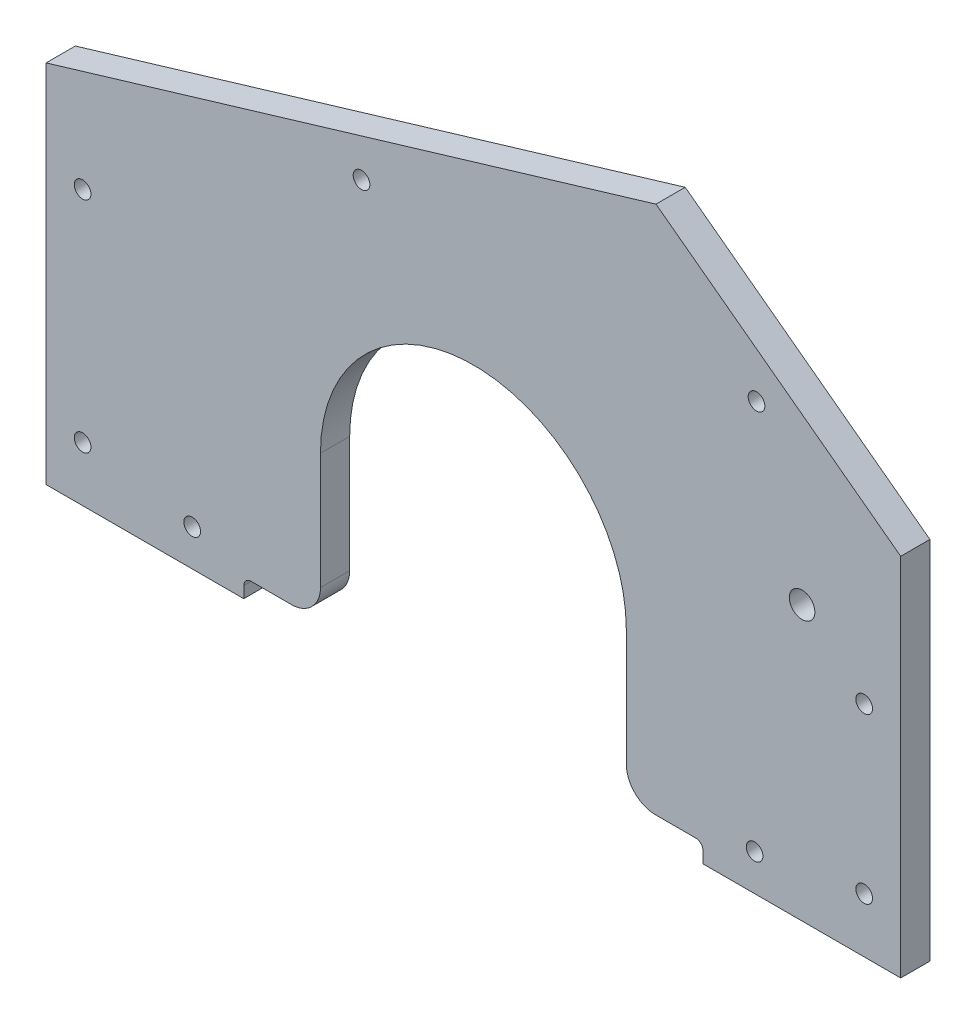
from build123d import *

# Parameters (mm, degrees)
SKETCH1_R               = 2.285
BOSS_EXTRUDE1_DEPTH     = 8
SKETCH2_R               = 15
BOSS_EXTRUDE2_DEPTH     = 15
CUT_EXTRUDE1_DEPTH      = 2
CUT_EXTRUDE1_DEPTH_BACK = 18
SKETCH3_R               = 3.5
CUT_EXTRUDE2_START      = -10.222
SKETCH4_R               = 7.7375
CUT_EXTRUDE2_DEPTH      = 6
FILLET1_R               = 8
FILLET2_R               = 2
CHAMFER1_SIZE           = 2


with BuildPart() as part:
    # Sketch1 → Boss-Extrude1 (new body)
    with BuildSketch(Plane.XY):
        Polygon((-135.206606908, -69.673474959), (-135.206606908, 30.326525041), (31.793393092, 80.326525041), (98.793393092, 30.326525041), (98.793393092, -69.673474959), align=None)
        with Locations((-125.206606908, 5.326525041)):
            Circle(SKETCH1_R, mode=Mode.SUBTRACT)
        with Locations((-95.206606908, -59.673474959)):
            Circle(SKETCH1_R, mode=Mode.SUBTRACT)
        with Locations((59.312548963, 47.312193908)):
            Circle(SKETCH1_R, mode=Mode.SUBTRACT)
        with Locations((-48.838391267, 45.7466848)):
            Circle(SKETCH1_R, mode=Mode.SUBTRACT)
        with Locations(Location((58.793393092, -59.673474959, 0), (0, 0, 180))):
            Circle(SKETCH1_R, mode=Mode.SUBTRACT)
        with Locations(Location((-125.206606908, -54.673474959, 0), (0, 0, 180))):
            Circle(SKETCH1_R, mode=Mode.SUBTRACT)
        with Locations((88.793393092, -54.673474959)):
            Circle(SKETCH1_R, mode=Mode.SUBTRACT)
        with Locations((88.793393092, -9.673474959)):
            Circle(SKETCH1_R, mode=Mode.SUBTRACT)
    extrude(amount=-BOSS_EXTRUDE1_DEPTH)

    # Sketch2 → Boss-Extrude2 (add)
    with BuildSketch(Plane.XY):
        with Locations((71.793393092, 5.326525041)):
            Circle(SKETCH2_R)
    extrude(amount=-BOSS_EXTRUDE2_DEPTH)

    # Sketch3 → Cut-Extrude1 (cut, two sides: drawn at the far end of the back side and taken through both)
    with BuildSketch(Plane.XY.offset(-CUT_EXTRUDE1_DEPTH_BACK)):
        with Locations(Location((71.793393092, 5.326525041, 0), (0, 0, 180))):
            Circle(SKETCH3_R)
        with BuildLine():
            Line((44.668393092, -69.673474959), (44.668393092, -64.543474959))
            Line((44.668393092, -64.543474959), (23.668393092, -64.543474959))
            Line((23.668393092, -64.543474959), (23.668393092, -24.673474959))
            ThreePointArc((23.668393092, -24.673474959), (-18.206606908, 17.201525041), (-60.081606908, -24.673474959))
            Line((-60.081606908, -24.673474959), (-60.081606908, -64.543474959))
            Line((-60.081606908, -64.543474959), (-81.081606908, -64.543474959))
            Line((-81.081606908, -64.543474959), (-81.081606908, -69.673474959))
            Line((-81.081606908, -69.673474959), (-81.081606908, -72.333497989))
            Line((-81.081606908, -72.333497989), (44.668393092, -72.333497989))
            Line((44.668393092, -72.333497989), (44.668393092, -69.673474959))
        make_face()
    extrude(amount=CUT_EXTRUDE1_DEPTH + CUT_EXTRUDE1_DEPTH_BACK, mode=Mode.SUBTRACT)

    # Sketch4 → Cut-Extrude2 (cut)
    with BuildSketch(Plane.XY.offset(CUT_EXTRUDE2_START)):
        with Locations((71.793393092, 5.326525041)):
            Circle(SKETCH4_R)
    extrude(amount=-CUT_EXTRUDE2_DEPTH, mode=Mode.SUBTRACT)

    # Fillet1
    fillet1_edges = [part.edges().sort_by_distance(p)[0] for p in [
        (-60.081606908, -64.543474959, -4),
        (23.668393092, -64.543474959, -4),
    ]]
    fillet(fillet1_edges, radius=FILLET1_R)

    # Fillet2
    fillet2_edges = [part.edges().sort_by_distance(p)[0] for p in [
        (44.668393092, -64.543474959, -4),
        (-81.081606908, -64.543474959, -4),
    ]]
    fillet(fillet2_edges, radius=FILLET2_R)

    # Chamfer1
    chamfer1_edges = [part.edges().sort_by_distance(p)[0] for p in [
        (56.793393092, 5.326525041, -8),
    ]]
    chamfer(chamfer1_edges, length=CHAMFER1_SIZE)


solid = part.part
